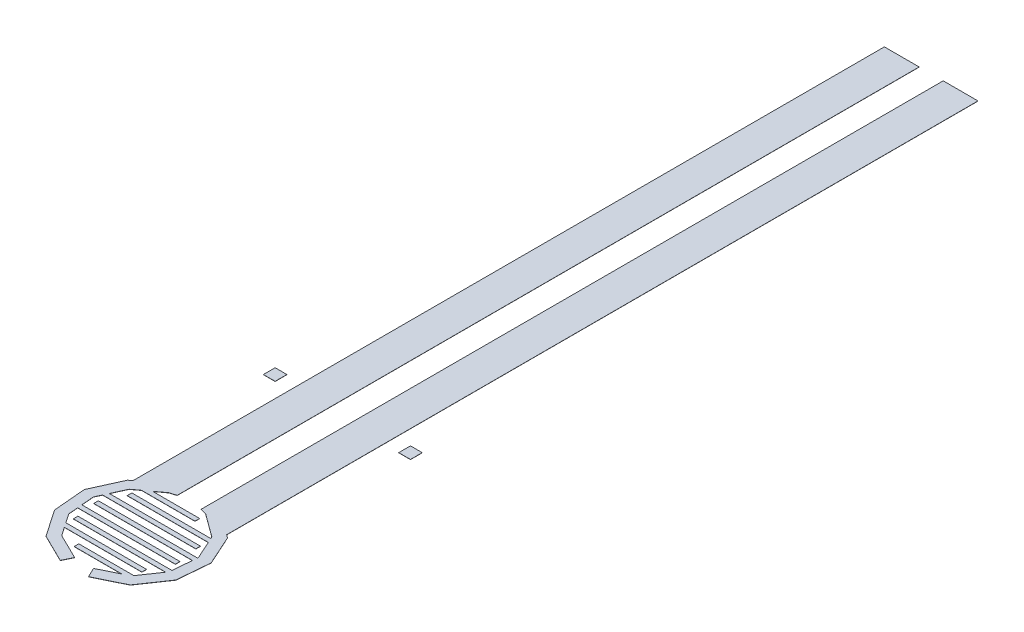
from build123d import *

# Parameters (mm, degrees)
SKETCH2_W        = 0.508
SKETCH2_H        = 0.508
EXTRUDE1_DEPTH   = 0.007
EXTRUDE1_2_DEPTH = 0.007
EXTRUDE1_3_DEPTH = 0.007
EXTRUDE1_4_DEPTH = 0.007


with BuildPart() as part:
    # Sketch2 → Extrude1 (new body)
    with BuildSketch(Plane(origin=(0, 0, 0), x_dir=(1, 0, 0), z_dir=(0, 1, 0))):
        with Locations((-2.88996182, 8.886320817)):
            Rectangle(SKETCH2_W, SKETCH2_H)
    extrude(amount=EXTRUDE1_DEPTH)


with BuildPart() as body_2:
    # Sketch2 → Extrude1 2 (new body)
    with BuildSketch(Plane(origin=(0, 0, 0), x_dir=(1, 0, 0), z_dir=(0, 1, 0))):
        with Locations((2.95203818, 8.886320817)):
            Rectangle(SKETCH2_W, SKETCH2_H)
    extrude(amount=EXTRUDE1_2_DEPTH)


with BuildPart() as body_3:
    # Sketch2 → Extrude1 3 (new body)
    with BuildSketch(Plane(origin=(0, 0, 0), x_dir=(1, 0, 0), z_dir=(0, 1, 0))):
        Polygon((2.05203818, 34.286320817), (0.55003818, 34.286320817), (0.55003818, 2.254320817), (0.825982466, 2.171937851), (1.816877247, 1.447055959), (1.853462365, 1.366321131), (-1.555963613, 1.366321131), (-1.555963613, 1.166321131), (1.944092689, 1.166321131), (2.298635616, 0.383927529), (2.295704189, 0.350320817), (-1.985024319, 0.350320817), (-1.985024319, 0.150320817), (2.278258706, 0.150320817), (2.207081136, -0.665679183), (-1.852676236, -0.665679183), (-1.852676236, -0.865679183), (2.137915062, -0.865679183), (1.580123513, -1.681679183), (-0.80029959, -1.681679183), (-0.80029959, -1.881679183), (1.25627741, -1.881679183), (0.436774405, -2.284115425), (0.641301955, -2.700606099), (1.852111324, -2.106009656), (2.648879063, -0.940408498), (2.77144433, 0.464714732), (2.189202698, 1.749586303), (2.05203818, 1.849928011), align=None)
    extrude(amount=EXTRUDE1_3_DEPTH)


with BuildPart() as body_4:
    # Sketch2 → Extrude1 4 (new body)
    with BuildSketch(Plane(origin=(0, 0, 0), x_dir=(1, 0, 0), z_dir=(0, 1, 0))):
        Polygon((-0.48796182, 34.286320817), (-1.98996182, 34.286320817), (-1.98996182, 1.849928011), (-2.127126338, 1.749586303), (-2.70936797, 0.464714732), (-2.586802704, -0.940408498), (-1.790034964, -2.106009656), (-0.579225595, -2.700606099), (-0.374698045, -2.284115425), (-1.475892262, -1.743348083), (-1.72858612, -1.373679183), (1.617267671, -1.373679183), (1.617267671, -1.173679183), (-1.865299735, -1.173679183), (-2.135124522, -0.778949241), (-2.17187082, -0.357679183), (2.047100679, -0.357679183), (2.047100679, -0.157679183), (-2.189316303, -0.157679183), (-2.236559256, 0.383927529), (-2.112217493, 0.658320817), (1.914752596, 0.658320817), (1.914752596, 0.858320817), (-2.02158717, 0.858320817), (-1.754800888, 1.447055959), (-1.444135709, 1.674320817), (0.86237595, 1.674320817), (0.86237595, 1.874320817), (-1.170740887, 1.874320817), (-0.763906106, 2.171937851), (-0.48796182, 2.254320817), align=None)
    extrude(amount=EXTRUDE1_4_DEPTH)


solid = Compound([part.part, body_2.part, body_3.part, body_4.part])
